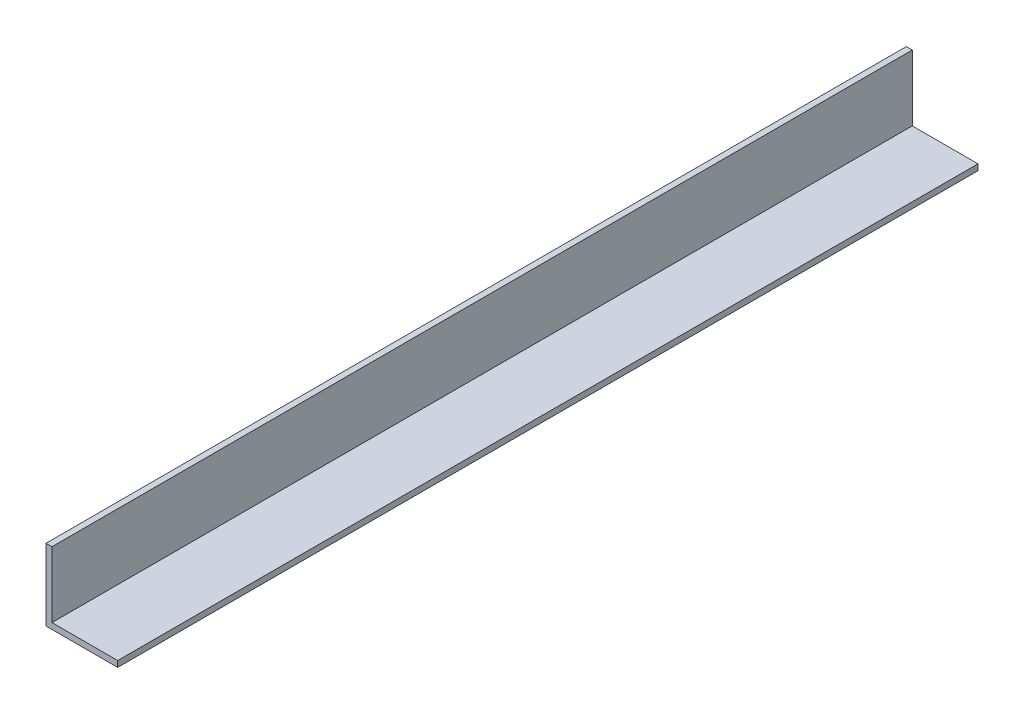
ISO-10303-21;
HEADER;
FILE_DESCRIPTION(('STEP AP214'),'2;1');
FILE_NAME('part.step','',(''),(''),'','','');
FILE_SCHEMA(('AUTOMOTIVE_DESIGN { 1 0 10303 214 1 1 1 1 }'));
ENDSEC;
DATA;
#1=APPLICATION_CONTEXT('core data for automotive mechanical design processes');
#2=APPLICATION_PROTOCOL_DEFINITION('international standard','automotive_design',2000,#1);
#3=PRODUCT_CONTEXT('',#1,'mechanical');
#4=PRODUCT('Part','Part','',(#3));
#5=PRODUCT_RELATED_PRODUCT_CATEGORY('part','',(#4));
#6=PRODUCT_DEFINITION_FORMATION('','',#4);
#7=PRODUCT_DEFINITION_CONTEXT('part definition',#1,'design');
#8=PRODUCT_DEFINITION('design','',#6,#7);
#9=PRODUCT_DEFINITION_SHAPE('','',#8);
#10=(LENGTH_UNIT() NAMED_UNIT(*) SI_UNIT(.MILLI.,.METRE.));
#11=(NAMED_UNIT(*) PLANE_ANGLE_UNIT() SI_UNIT($,.RADIAN.));
#12=(NAMED_UNIT(*) SI_UNIT($,.STERADIAN.) SOLID_ANGLE_UNIT());
#13=UNCERTAINTY_MEASURE_WITH_UNIT(LENGTH_MEASURE(1.E-05),#10,'distance_accuracy_value','');
#14=(GEOMETRIC_REPRESENTATION_CONTEXT(3) GLOBAL_UNCERTAINTY_ASSIGNED_CONTEXT((#13)) GLOBAL_UNIT_ASSIGNED_CONTEXT((#10,
#11,#12)) REPRESENTATION_CONTEXT('',''));
#15=CARTESIAN_POINT('',(0.,0.,0.));
#16=DIRECTION('',(0.,0.,1.));
#17=DIRECTION('',(1.,0.,0.));
#18=AXIS2_PLACEMENT_3D('',#15,#16,#17);
#19=CARTESIAN_POINT('',(0.,38.1,457.2));
#20=DIRECTION('',(0.,-1.,0.));
#21=DIRECTION('',(0.,0.,-1.));
#22=AXIS2_PLACEMENT_3D('',#19,#20,#21);
#23=PLANE('',#22);
#24=DIRECTION('',(-1.,0.,0.));
#25=VECTOR('',#24,1.);
#26=CARTESIAN_POINT('',(0.,38.1,0.));
#27=LINE('',#26,#25);
#28=CARTESIAN_POINT('',(3.175,38.1,0.));
#29=VERTEX_POINT('',#28);
#30=CARTESIAN_POINT('',(0.,38.1,0.));
#31=VERTEX_POINT('',#30);
#32=EDGE_CURVE('E115',#29,#31,#27,.T.);
#33=ORIENTED_EDGE('',*,*,#32,.T.);
#34=DIRECTION('',(0.,0.,-1.));
#35=VECTOR('',#34,1.);
#36=CARTESIAN_POINT('',(0.,38.1,457.2));
#37=LINE('',#36,#35);
#38=CARTESIAN_POINT('',(0.,38.1,457.2));
#39=VERTEX_POINT('',#38);
#40=EDGE_CURVE('E11',#39,#31,#37,.T.);
#41=ORIENTED_EDGE('',*,*,#40,.F.);
#42=DIRECTION('',(-1.,0.,0.));
#43=VECTOR('',#42,1.);
#44=CARTESIAN_POINT('',(0.,38.1,457.2));
#45=LINE('',#44,#43);
#46=CARTESIAN_POINT('',(3.175,38.1,457.2));
#47=VERTEX_POINT('',#46);
#48=EDGE_CURVE('E125',#47,#39,#45,.T.);
#49=ORIENTED_EDGE('',*,*,#48,.F.);
#50=DIRECTION('',(0.,0.,-1.));
#51=VECTOR('',#50,1.);
#52=CARTESIAN_POINT('',(3.175,38.1,457.2));
#53=LINE('',#52,#51);
#54=EDGE_CURVE('E111',#47,#29,#53,.T.);
#55=ORIENTED_EDGE('',*,*,#54,.T.);
#56=EDGE_LOOP('',(#33,#41,#49,#55));
#57=FACE_BOUND('',#56,.T.);
#58=ADVANCED_FACE('F31',(#57),#23,.F.);
#59=CARTESIAN_POINT('',(0.,38.1,457.2));
#60=DIRECTION('',(1.,0.,0.));
#61=DIRECTION('',(0.,1.,0.));
#62=AXIS2_PLACEMENT_3D('',#59,#60,#61);
#63=PLANE('',#62);
#64=DIRECTION('',(0.,-1.,0.));
#65=VECTOR('',#64,1.);
#66=CARTESIAN_POINT('',(0.,38.1,0.));
#67=LINE('',#66,#65);
#68=CARTESIAN_POINT('',(0.,0.,0.));
#69=VERTEX_POINT('',#68);
#70=EDGE_CURVE('E118',#31,#69,#67,.T.);
#71=ORIENTED_EDGE('',*,*,#70,.T.);
#72=DIRECTION('',(0.,0.,-1.));
#73=VECTOR('',#72,1.);
#74=CARTESIAN_POINT('',(0.,0.,457.2));
#75=LINE('',#74,#73);
#76=CARTESIAN_POINT('',(0.,0.,457.2));
#77=VERTEX_POINT('',#76);
#78=EDGE_CURVE('E39',#77,#69,#75,.T.);
#79=ORIENTED_EDGE('',*,*,#78,.F.);
#80=DIRECTION('',(0.,-1.,0.));
#81=VECTOR('',#80,1.);
#82=CARTESIAN_POINT('',(0.,38.1,457.2));
#83=LINE('',#82,#81);
#84=EDGE_CURVE('E84',#39,#77,#83,.T.);
#85=ORIENTED_EDGE('',*,*,#84,.F.);
#86=ORIENTED_EDGE('',*,*,#40,.T.);
#87=EDGE_LOOP('',(#71,#79,#85,#86));
#88=FACE_BOUND('',#87,.T.);
#89=ADVANCED_FACE('F149',(#88),#63,.F.);
#90=CARTESIAN_POINT('',(0.,0.,457.2));
#91=DIRECTION('',(0.,1.,0.));
#92=DIRECTION('',(0.,0.,1.));
#93=AXIS2_PLACEMENT_3D('',#90,#91,#92);
#94=PLANE('',#93);
#95=DIRECTION('',(1.,0.,0.));
#96=VECTOR('',#95,1.);
#97=CARTESIAN_POINT('',(0.,0.,0.));
#98=LINE('',#97,#96);
#99=CARTESIAN_POINT('',(38.1,0.,0.));
#100=VERTEX_POINT('',#99);
#101=EDGE_CURVE('E120',#69,#100,#98,.T.);
#102=ORIENTED_EDGE('',*,*,#101,.T.);
#103=DIRECTION('',(0.,0.,-1.));
#104=VECTOR('',#103,1.);
#105=CARTESIAN_POINT('',(38.1,0.,457.2));
#106=LINE('',#105,#104);
#107=CARTESIAN_POINT('',(38.1,0.,457.2));
#108=VERTEX_POINT('',#107);
#109=EDGE_CURVE('E106',#108,#100,#106,.T.);
#110=ORIENTED_EDGE('',*,*,#109,.F.);
#111=DIRECTION('',(1.,0.,0.));
#112=VECTOR('',#111,1.);
#113=CARTESIAN_POINT('',(0.,0.,457.2));
#114=LINE('',#113,#112);
#115=EDGE_CURVE('E97',#77,#108,#114,.T.);
#116=ORIENTED_EDGE('',*,*,#115,.F.);
#117=ORIENTED_EDGE('',*,*,#78,.T.);
#118=EDGE_LOOP('',(#102,#110,#116,#117));
#119=FACE_BOUND('',#118,.T.);
#120=ADVANCED_FACE('F131',(#119),#94,.F.);
#121=CARTESIAN_POINT('',(38.1,0.,457.2));
#122=DIRECTION('',(-1.,0.,0.));
#123=DIRECTION('',(0.,0.,1.));
#124=AXIS2_PLACEMENT_3D('',#121,#122,#123);
#125=PLANE('',#124);
#126=DIRECTION('',(0.,1.,0.));
#127=VECTOR('',#126,1.);
#128=CARTESIAN_POINT('',(38.1,0.,0.));
#129=LINE('',#128,#127);
#130=CARTESIAN_POINT('',(38.1,3.175,0.));
#131=VERTEX_POINT('',#130);
#132=EDGE_CURVE('E105',#100,#131,#129,.T.);
#133=ORIENTED_EDGE('',*,*,#132,.T.);
#134=DIRECTION('',(0.,0.,-1.));
#135=VECTOR('',#134,1.);
#136=CARTESIAN_POINT('',(38.1,3.175,457.2));
#137=LINE('',#136,#135);
#138=CARTESIAN_POINT('',(38.1,3.175,457.2));
#139=VERTEX_POINT('',#138);
#140=EDGE_CURVE('E102',#139,#131,#137,.T.);
#141=ORIENTED_EDGE('',*,*,#140,.F.);
#142=DIRECTION('',(0.,1.,0.));
#143=VECTOR('',#142,1.);
#144=CARTESIAN_POINT('',(38.1,0.,457.2));
#145=LINE('',#144,#143);
#146=EDGE_CURVE('E91',#108,#139,#145,.T.);
#147=ORIENTED_EDGE('',*,*,#146,.F.);
#148=ORIENTED_EDGE('',*,*,#109,.T.);
#149=EDGE_LOOP('',(#133,#141,#147,#148));
#150=FACE_BOUND('',#149,.T.);
#151=ADVANCED_FACE('F103',(#150),#125,.F.);
#152=CARTESIAN_POINT('',(3.175,3.175,457.2));
#153=DIRECTION('',(0.,-1.,0.));
#154=DIRECTION('',(0.,0.,-1.));
#155=AXIS2_PLACEMENT_3D('',#152,#153,#154);
#156=PLANE('',#155);
#157=DIRECTION('',(-1.,0.,0.));
#158=VECTOR('',#157,1.);
#159=CARTESIAN_POINT('',(3.175,3.175,0.));
#160=LINE('',#159,#158);
#161=CARTESIAN_POINT('',(3.175,3.175,0.));
#162=VERTEX_POINT('',#161);
#163=EDGE_CURVE('E70',#131,#162,#160,.T.);
#164=ORIENTED_EDGE('',*,*,#163,.T.);
#165=DIRECTION('',(0.,0.,-1.));
#166=VECTOR('',#165,1.);
#167=CARTESIAN_POINT('',(3.175,3.175,457.2));
#168=LINE('',#167,#166);
#169=CARTESIAN_POINT('',(3.175,3.175,457.2));
#170=VERTEX_POINT('',#169);
#171=EDGE_CURVE('E107',#170,#162,#168,.T.);
#172=ORIENTED_EDGE('',*,*,#171,.F.);
#173=DIRECTION('',(-1.,0.,0.));
#174=VECTOR('',#173,1.);
#175=CARTESIAN_POINT('',(3.175,3.175,457.2));
#176=LINE('',#175,#174);
#177=EDGE_CURVE('E95',#139,#170,#176,.T.);
#178=ORIENTED_EDGE('',*,*,#177,.F.);
#179=ORIENTED_EDGE('',*,*,#140,.T.);
#180=EDGE_LOOP('',(#164,#172,#178,#179));
#181=FACE_BOUND('',#180,.T.);
#182=ADVANCED_FACE('F109',(#181),#156,.F.);
#183=CARTESIAN_POINT('',(3.175,38.1,457.2));
#184=DIRECTION('',(-1.,0.,0.));
#185=DIRECTION('',(0.,-1.,0.));
#186=AXIS2_PLACEMENT_3D('',#183,#184,#185);
#187=PLANE('',#186);
#188=DIRECTION('',(0.,1.,0.));
#189=VECTOR('',#188,1.);
#190=CARTESIAN_POINT('',(3.175,38.1,0.));
#191=LINE('',#190,#189);
#192=EDGE_CURVE('E76',#162,#29,#191,.T.);
#193=ORIENTED_EDGE('',*,*,#192,.T.);
#194=ORIENTED_EDGE('',*,*,#54,.F.);
#195=DIRECTION('',(0.,1.,0.));
#196=VECTOR('',#195,1.);
#197=CARTESIAN_POINT('',(3.175,38.1,457.2));
#198=LINE('',#197,#196);
#199=EDGE_CURVE('E47',#170,#47,#198,.T.);
#200=ORIENTED_EDGE('',*,*,#199,.F.);
#201=ORIENTED_EDGE('',*,*,#171,.T.);
#202=EDGE_LOOP('',(#193,#194,#200,#201));
#203=FACE_BOUND('',#202,.T.);
#204=ADVANCED_FACE('F138',(#203),#187,.F.);
#205=CARTESIAN_POINT('',(38.1,38.1,457.2));
#206=DIRECTION('',(0.,0.,1.));
#207=DIRECTION('',(1.,0.,0.));
#208=AXIS2_PLACEMENT_3D('',#205,#206,#207);
#209=PLANE('',#208);
#210=ORIENTED_EDGE('',*,*,#48,.T.);
#211=ORIENTED_EDGE('',*,*,#84,.T.);
#212=ORIENTED_EDGE('',*,*,#115,.T.);
#213=ORIENTED_EDGE('',*,*,#146,.T.);
#214=ORIENTED_EDGE('',*,*,#177,.T.);
#215=ORIENTED_EDGE('',*,*,#199,.T.);
#216=EDGE_LOOP('',(#210,#211,#212,#213,#214,#215));
#217=FACE_BOUND('',#216,.T.);
#218=ADVANCED_FACE('F93',(#217),#209,.T.);
#219=CARTESIAN_POINT('',(38.1,38.1,0.));
#220=DIRECTION('',(0.,0.,1.));
#221=DIRECTION('',(1.,0.,0.));
#222=AXIS2_PLACEMENT_3D('',#219,#220,#221);
#223=PLANE('',#222);
#224=ORIENTED_EDGE('',*,*,#32,.F.);
#225=ORIENTED_EDGE('',*,*,#192,.F.);
#226=ORIENTED_EDGE('',*,*,#163,.F.);
#227=ORIENTED_EDGE('',*,*,#132,.F.);
#228=ORIENTED_EDGE('',*,*,#101,.F.);
#229=ORIENTED_EDGE('',*,*,#70,.F.);
#230=EDGE_LOOP('',(#224,#225,#226,#227,#228,#229));
#231=FACE_BOUND('',#230,.T.);
#232=ADVANCED_FACE('F134',(#231),#223,.F.);
#233=CLOSED_SHELL('',(#58,#89,#120,#151,#182,#204,#218,#232));
#234=MANIFOLD_SOLID_BREP('B2',#233);
#235=ADVANCED_BREP_SHAPE_REPRESENTATION('',(#18,#234),#14);
#236=SHAPE_DEFINITION_REPRESENTATION(#9,#235);
ENDSEC;
END-ISO-10303-21;
